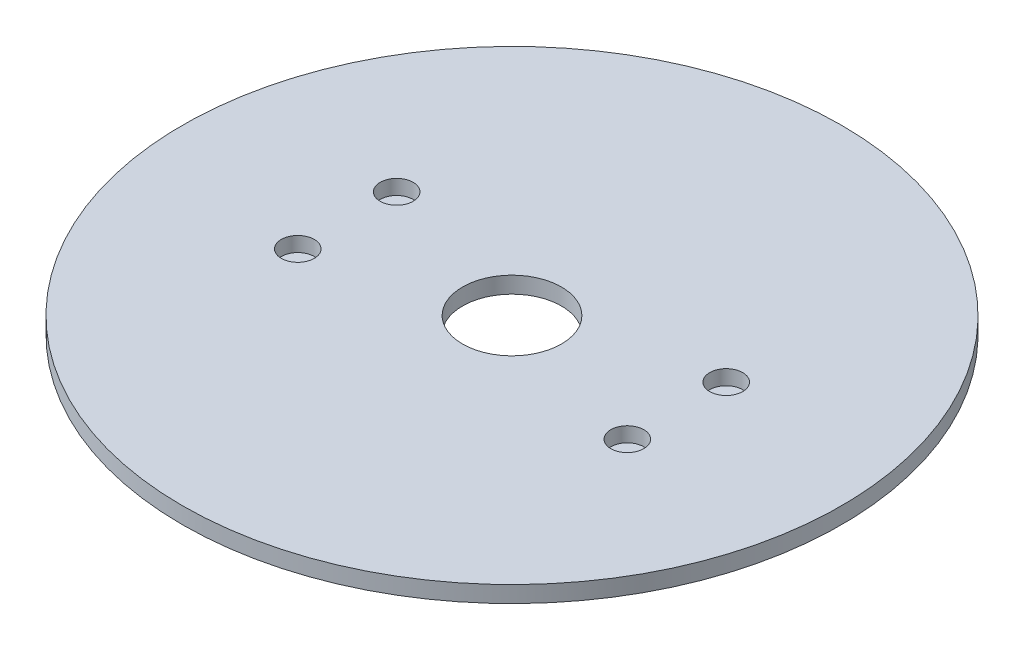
from build123d import *

# Parameters (mm, degrees)
SKETCH1_R           = 1000
BOSS_EXTRUDE1_DEPTH = 50
SKETCH2_R           = 50
CUT_EXTRUDE2_DEPTH  = 45
SKETCH2_4_R         = 50
CUT_EXTRUDE3_DEPTH  = 45
SKETCH3_R           = 50
CUT_EXTRUDE4_DEPTH  = 45
SKETCH4_R           = 150
CUT_EXTRUDE5_DEPTH  = 50


with BuildPart() as part:
    # Sketch1 → Boss-Extrude1 (new body)
    with BuildSketch(Plane(origin=(0, 0, 0), x_dir=(1, 0, 0), z_dir=(0, 1, 0))):
        with Locations(Location((0, 0, 0), (0, 0, 270))):
            Circle(SKETCH1_R)
    extrude(amount=BOSS_EXTRUDE1_DEPTH)

    # Sketch2 → Cut-Extrude2 (cut)
    with BuildSketch(Plane(origin=(0, 50, 0), x_dir=(1, 0, 0), z_dir=(0, 1, 0))):
        with Locations(Location((500, 150, 0), (0, 0, 270))):
            Circle(SKETCH2_R)
    extrude(amount=-CUT_EXTRUDE2_DEPTH, mode=Mode.SUBTRACT)

    # Sketch2_4 → Cut-Extrude3 (cut)
    with BuildSketch(Plane(origin=(0, 50, 0), x_dir=(1, 0, 0), z_dir=(0, 1, 0))):
        with Locations(Location((500, -150, 0), (0, 0, 270))):
            Circle(SKETCH2_4_R)
    extrude(amount=-CUT_EXTRUDE3_DEPTH, mode=Mode.SUBTRACT)

    # Sketch3 → Cut-Extrude4 (cut)
    with BuildSketch(Plane(origin=(0, 50, 0), x_dir=(1, 0, 0), z_dir=(0, 1, 0))):
        with Locations(Location((-500, 150, 0), (0, 0, 270))):
            Circle(SKETCH3_R)
        with Locations(Location((-500, -150, 0), (0, 0, 270))):
            Circle(SKETCH3_R)
    extrude(amount=-CUT_EXTRUDE4_DEPTH, mode=Mode.SUBTRACT)

    # Sketch4 → Cut-Extrude5 (cut)
    with BuildSketch(Plane(origin=(0, 50, 0), x_dir=(1, 0, 0), z_dir=(0, 1, 0))):
        with Locations(Location((0, 0, 0), (0, 0, 270))):
            Circle(SKETCH4_R)
    extrude(amount=-CUT_EXTRUDE5_DEPTH, mode=Mode.SUBTRACT)


solid = part.part
